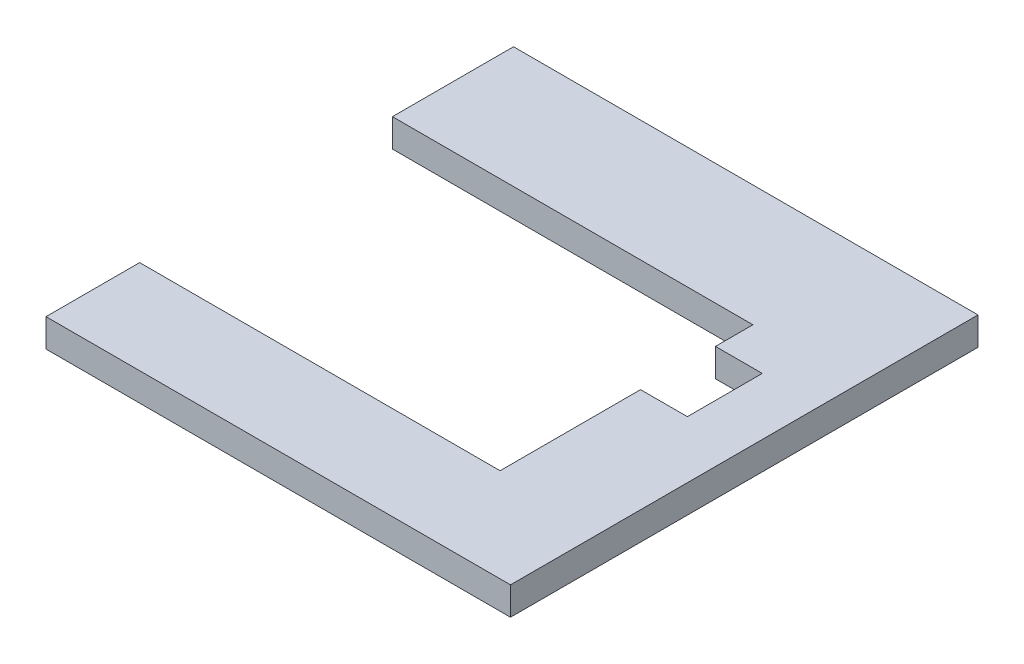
ISO-10303-21;
HEADER;
FILE_DESCRIPTION(('STEP AP214'),'2;1');
FILE_NAME('part.step','',(''),(''),'','','');
FILE_SCHEMA(('AUTOMOTIVE_DESIGN { 1 0 10303 214 1 1 1 1 }'));
ENDSEC;
DATA;
#1=APPLICATION_CONTEXT('core data for automotive mechanical design processes');
#2=APPLICATION_PROTOCOL_DEFINITION('international standard','automotive_design',2000,#1);
#3=PRODUCT_CONTEXT('',#1,'mechanical');
#4=PRODUCT('Part','Part','',(#3));
#5=PRODUCT_RELATED_PRODUCT_CATEGORY('part','',(#4));
#6=PRODUCT_DEFINITION_FORMATION('','',#4);
#7=PRODUCT_DEFINITION_CONTEXT('part definition',#1,'design');
#8=PRODUCT_DEFINITION('design','',#6,#7);
#9=PRODUCT_DEFINITION_SHAPE('','',#8);
#10=(LENGTH_UNIT() NAMED_UNIT(*) SI_UNIT(.MILLI.,.METRE.));
#11=(NAMED_UNIT(*) PLANE_ANGLE_UNIT() SI_UNIT($,.RADIAN.));
#12=(NAMED_UNIT(*) SI_UNIT($,.STERADIAN.) SOLID_ANGLE_UNIT());
#13=UNCERTAINTY_MEASURE_WITH_UNIT(LENGTH_MEASURE(1.E-05),#10,'distance_accuracy_value','');
#14=(GEOMETRIC_REPRESENTATION_CONTEXT(3) GLOBAL_UNCERTAINTY_ASSIGNED_CONTEXT((#13)) GLOBAL_UNIT_ASSIGNED_CONTEXT((#10,
#11,#12)) REPRESENTATION_CONTEXT('',''));
#15=CARTESIAN_POINT('',(0.,0.,0.));
#16=DIRECTION('',(0.,0.,1.));
#17=DIRECTION('',(1.,0.,0.));
#18=AXIS2_PLACEMENT_3D('',#15,#16,#17);
#19=CARTESIAN_POINT('',(49.6102375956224,3.,0.));
#20=DIRECTION('',(1.,0.,0.));
#21=DIRECTION('',(0.,0.,-1.));
#22=AXIS2_PLACEMENT_3D('',#19,#20,#21);
#23=PLANE('',#22);
#24=DIRECTION('',(0.,0.,1.));
#25=VECTOR('',#24,1.);
#26=CARTESIAN_POINT('',(49.6102375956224,0.,0.));
#27=LINE('',#26,#25);
#28=CARTESIAN_POINT('',(49.6102375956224,0.,-49.9319893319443));
#29=VERTEX_POINT('',#28);
#30=CARTESIAN_POINT('',(49.6102375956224,0.,0.));
#31=VERTEX_POINT('',#30);
#32=EDGE_CURVE('E267',#29,#31,#27,.T.);
#33=ORIENTED_EDGE('',*,*,#32,.F.);
#34=DIRECTION('',(0.,-1.,0.));
#35=VECTOR('',#34,1.);
#36=CARTESIAN_POINT('',(49.6102375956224,3.,-49.9319893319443));
#37=LINE('',#36,#35);
#38=CARTESIAN_POINT('',(49.6102375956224,3.,-49.9319893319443));
#39=VERTEX_POINT('',#38);
#40=EDGE_CURVE('E12',#39,#29,#37,.T.);
#41=ORIENTED_EDGE('',*,*,#40,.F.);
#42=DIRECTION('',(0.,0.,1.));
#43=VECTOR('',#42,1.);
#44=CARTESIAN_POINT('',(49.6102375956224,3.,0.));
#45=LINE('',#44,#43);
#46=CARTESIAN_POINT('',(49.6102375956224,3.,0.));
#47=VERTEX_POINT('',#46);
#48=EDGE_CURVE('E214',#39,#47,#45,.T.);
#49=ORIENTED_EDGE('',*,*,#48,.T.);
#50=DIRECTION('',(0.,-1.,0.));
#51=VECTOR('',#50,1.);
#52=CARTESIAN_POINT('',(49.6102375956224,3.,0.));
#53=LINE('',#52,#51);
#54=EDGE_CURVE('E111',#47,#31,#53,.T.);
#55=ORIENTED_EDGE('',*,*,#54,.T.);
#56=EDGE_LOOP('',(#33,#41,#49,#55));
#57=FACE_BOUND('',#56,.T.);
#58=ADVANCED_FACE('F48',(#57),#23,.T.);
#59=CARTESIAN_POINT('',(0.,3.,-49.9319893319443));
#60=DIRECTION('',(0.,0.,-1.));
#61=DIRECTION('',(-1.,0.,0.));
#62=AXIS2_PLACEMENT_3D('',#59,#60,#61);
#63=PLANE('',#62);
#64=DIRECTION('',(1.,0.,0.));
#65=VECTOR('',#64,1.);
#66=CARTESIAN_POINT('',(0.,0.,-49.9319893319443));
#67=LINE('',#66,#65);
#68=CARTESIAN_POINT('',(0.,0.,-49.9319893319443));
#69=VERTEX_POINT('',#68);
#70=EDGE_CURVE('E263',#69,#29,#67,.T.);
#71=ORIENTED_EDGE('',*,*,#70,.F.);
#72=DIRECTION('',(0.,-1.,0.));
#73=VECTOR('',#72,1.);
#74=CARTESIAN_POINT('',(0.,3.,-49.9319893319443));
#75=LINE('',#74,#73);
#76=CARTESIAN_POINT('',(0.,3.,-49.9319893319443));
#77=VERTEX_POINT('',#76);
#78=EDGE_CURVE('E57',#77,#69,#75,.T.);
#79=ORIENTED_EDGE('',*,*,#78,.F.);
#80=DIRECTION('',(1.,0.,0.));
#81=VECTOR('',#80,1.);
#82=CARTESIAN_POINT('',(0.,3.,-49.9319893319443));
#83=LINE('',#82,#81);
#84=EDGE_CURVE('E209',#77,#39,#83,.T.);
#85=ORIENTED_EDGE('',*,*,#84,.T.);
#86=ORIENTED_EDGE('',*,*,#40,.T.);
#87=EDGE_LOOP('',(#71,#79,#85,#86));
#88=FACE_BOUND('',#87,.T.);
#89=ADVANCED_FACE('F264',(#88),#63,.T.);
#90=CARTESIAN_POINT('',(0.,3.,0.));
#91=DIRECTION('',(-1.,0.,0.));
#92=DIRECTION('',(0.,0.,1.));
#93=AXIS2_PLACEMENT_3D('',#90,#91,#92);
#94=PLANE('',#93);
#95=DIRECTION('',(0.,0.,-1.));
#96=VECTOR('',#95,1.);
#97=CARTESIAN_POINT('',(0.,0.,0.));
#98=LINE('',#97,#96);
#99=CARTESIAN_POINT('',(0.,0.,-37.));
#100=VERTEX_POINT('',#99);
#101=EDGE_CURVE('E258',#100,#69,#98,.T.);
#102=ORIENTED_EDGE('',*,*,#101,.F.);
#103=DIRECTION('',(0.,-1.,0.));
#104=VECTOR('',#103,1.);
#105=CARTESIAN_POINT('',(0.,3.,-37.));
#106=LINE('',#105,#104);
#107=CARTESIAN_POINT('',(0.,3.,-37.));
#108=VERTEX_POINT('',#107);
#109=EDGE_CURVE('E250',#108,#100,#106,.T.);
#110=ORIENTED_EDGE('',*,*,#109,.F.);
#111=DIRECTION('',(0.,0.,-1.));
#112=VECTOR('',#111,1.);
#113=CARTESIAN_POINT('',(0.,3.,0.));
#114=LINE('',#113,#112);
#115=EDGE_CURVE('E204',#108,#77,#114,.T.);
#116=ORIENTED_EDGE('',*,*,#115,.T.);
#117=ORIENTED_EDGE('',*,*,#78,.T.);
#118=EDGE_LOOP('',(#102,#110,#116,#117));
#119=FACE_BOUND('',#118,.T.);
#120=ADVANCED_FACE('F256',(#119),#94,.T.);
#121=CARTESIAN_POINT('',(0.,3.,-37.));
#122=DIRECTION('',(0.,0.,-1.));
#123=DIRECTION('',(-1.,0.,0.));
#124=AXIS2_PLACEMENT_3D('',#121,#122,#123);
#125=PLANE('',#124);
#126=DIRECTION('',(1.,0.,0.));
#127=VECTOR('',#126,1.);
#128=CARTESIAN_POINT('',(0.,0.,-37.));
#129=LINE('',#128,#127);
#130=CARTESIAN_POINT('',(38.5,0.,-37.));
#131=VERTEX_POINT('',#130);
#132=EDGE_CURVE('E273',#100,#131,#129,.T.);
#133=ORIENTED_EDGE('',*,*,#132,.T.);
#134=DIRECTION('',(0.,-1.,0.));
#135=VECTOR('',#134,1.);
#136=CARTESIAN_POINT('',(38.5,3.,-37.));
#137=LINE('',#136,#135);
#138=CARTESIAN_POINT('',(38.5,3.,-37.));
#139=VERTEX_POINT('',#138);
#140=EDGE_CURVE('E247',#139,#131,#137,.T.);
#141=ORIENTED_EDGE('',*,*,#140,.F.);
#142=DIRECTION('',(1.,0.,0.));
#143=VECTOR('',#142,1.);
#144=CARTESIAN_POINT('',(0.,3.,-37.));
#145=LINE('',#144,#143);
#146=EDGE_CURVE('E200',#108,#139,#145,.T.);
#147=ORIENTED_EDGE('',*,*,#146,.F.);
#148=ORIENTED_EDGE('',*,*,#109,.T.);
#149=EDGE_LOOP('',(#133,#141,#147,#148));
#150=FACE_BOUND('',#149,.T.);
#151=ADVANCED_FACE('F306',(#150),#125,.F.);
#152=CARTESIAN_POINT('',(38.5,3.,0.));
#153=DIRECTION('',(-1.,0.,0.));
#154=DIRECTION('',(0.,0.,1.));
#155=AXIS2_PLACEMENT_3D('',#152,#153,#154);
#156=PLANE('',#155);
#157=DIRECTION('',(0.,0.,-1.));
#158=VECTOR('',#157,1.);
#159=CARTESIAN_POINT('',(38.5,0.,0.));
#160=LINE('',#159,#158);
#161=CARTESIAN_POINT('',(38.5,0.,-33.));
#162=VERTEX_POINT('',#161);
#163=EDGE_CURVE('E277',#162,#131,#160,.T.);
#164=ORIENTED_EDGE('',*,*,#163,.F.);
#165=DIRECTION('',(0.,-1.,0.));
#166=VECTOR('',#165,1.);
#167=CARTESIAN_POINT('',(38.5,3.,-33.));
#168=LINE('',#167,#166);
#169=CARTESIAN_POINT('',(38.5,3.,-33.));
#170=VERTEX_POINT('',#169);
#171=EDGE_CURVE('E244',#170,#162,#168,.T.);
#172=ORIENTED_EDGE('',*,*,#171,.F.);
#173=DIRECTION('',(0.,0.,-1.));
#174=VECTOR('',#173,1.);
#175=CARTESIAN_POINT('',(38.5,3.,0.));
#176=LINE('',#175,#174);
#177=EDGE_CURVE('E196',#170,#139,#176,.T.);
#178=ORIENTED_EDGE('',*,*,#177,.T.);
#179=ORIENTED_EDGE('',*,*,#140,.T.);
#180=EDGE_LOOP('',(#164,#172,#178,#179));
#181=FACE_BOUND('',#180,.T.);
#182=ADVANCED_FACE('F311',(#181),#156,.T.);
#183=CARTESIAN_POINT('',(0.,3.,-33.));
#184=DIRECTION('',(0.,0.,-1.));
#185=DIRECTION('',(-1.,0.,0.));
#186=AXIS2_PLACEMENT_3D('',#183,#184,#185);
#187=PLANE('',#186);
#188=DIRECTION('',(1.,0.,0.));
#189=VECTOR('',#188,1.);
#190=CARTESIAN_POINT('',(0.,0.,-33.));
#191=LINE('',#190,#189);
#192=CARTESIAN_POINT('',(43.5,0.,-33.));
#193=VERTEX_POINT('',#192);
#194=EDGE_CURVE('E282',#162,#193,#191,.T.);
#195=ORIENTED_EDGE('',*,*,#194,.T.);
#196=DIRECTION('',(0.,-1.,0.));
#197=VECTOR('',#196,1.);
#198=CARTESIAN_POINT('',(43.5,3.,-33.));
#199=LINE('',#198,#197);
#200=CARTESIAN_POINT('',(43.5,3.,-33.));
#201=VERTEX_POINT('',#200);
#202=EDGE_CURVE('E240',#201,#193,#199,.T.);
#203=ORIENTED_EDGE('',*,*,#202,.F.);
#204=DIRECTION('',(1.,0.,0.));
#205=VECTOR('',#204,1.);
#206=CARTESIAN_POINT('',(0.,3.,-33.));
#207=LINE('',#206,#205);
#208=EDGE_CURVE('E188',#170,#201,#207,.T.);
#209=ORIENTED_EDGE('',*,*,#208,.F.);
#210=ORIENTED_EDGE('',*,*,#171,.T.);
#211=EDGE_LOOP('',(#195,#203,#209,#210));
#212=FACE_BOUND('',#211,.T.);
#213=ADVANCED_FACE('F315',(#212),#187,.F.);
#214=CARTESIAN_POINT('',(43.5,3.,0.));
#215=DIRECTION('',(1.,0.,0.));
#216=DIRECTION('',(0.,0.,-1.));
#217=AXIS2_PLACEMENT_3D('',#214,#215,#216);
#218=PLANE('',#217);
#219=DIRECTION('',(0.,0.,1.));
#220=VECTOR('',#219,1.);
#221=CARTESIAN_POINT('',(43.5,0.,0.));
#222=LINE('',#221,#220);
#223=CARTESIAN_POINT('',(43.5,0.,-25.));
#224=VERTEX_POINT('',#223);
#225=EDGE_CURVE('E285',#193,#224,#222,.T.);
#226=ORIENTED_EDGE('',*,*,#225,.T.);
#227=DIRECTION('',(0.,-1.,0.));
#228=VECTOR('',#227,1.);
#229=CARTESIAN_POINT('',(43.5,3.,-25.));
#230=LINE('',#229,#228);
#231=CARTESIAN_POINT('',(43.5,3.,-25.));
#232=VERTEX_POINT('',#231);
#233=EDGE_CURVE('E237',#232,#224,#230,.T.);
#234=ORIENTED_EDGE('',*,*,#233,.F.);
#235=DIRECTION('',(0.,0.,1.));
#236=VECTOR('',#235,1.);
#237=CARTESIAN_POINT('',(43.5,3.,0.));
#238=LINE('',#237,#236);
#239=EDGE_CURVE('E184',#201,#232,#238,.T.);
#240=ORIENTED_EDGE('',*,*,#239,.F.);
#241=ORIENTED_EDGE('',*,*,#202,.T.);
#242=EDGE_LOOP('',(#226,#234,#240,#241));
#243=FACE_BOUND('',#242,.T.);
#244=ADVANCED_FACE('F319',(#243),#218,.F.);
#245=CARTESIAN_POINT('',(0.,3.,-25.));
#246=DIRECTION('',(0.,0.,-1.));
#247=DIRECTION('',(-1.,0.,0.));
#248=AXIS2_PLACEMENT_3D('',#245,#246,#247);
#249=PLANE('',#248);
#250=DIRECTION('',(1.,0.,0.));
#251=VECTOR('',#250,1.);
#252=CARTESIAN_POINT('',(0.,0.,-25.));
#253=LINE('',#252,#251);
#254=CARTESIAN_POINT('',(38.5,0.,-25.));
#255=VERTEX_POINT('',#254);
#256=EDGE_CURVE('E289',#255,#224,#253,.T.);
#257=ORIENTED_EDGE('',*,*,#256,.F.);
#258=DIRECTION('',(0.,-1.,0.));
#259=VECTOR('',#258,1.);
#260=CARTESIAN_POINT('',(38.5,3.,-25.));
#261=LINE('',#260,#259);
#262=CARTESIAN_POINT('',(38.5,3.,-25.));
#263=VERTEX_POINT('',#262);
#264=EDGE_CURVE('E234',#263,#255,#261,.T.);
#265=ORIENTED_EDGE('',*,*,#264,.F.);
#266=DIRECTION('',(1.,0.,0.));
#267=VECTOR('',#266,1.);
#268=CARTESIAN_POINT('',(0.,3.,-25.));
#269=LINE('',#268,#267);
#270=EDGE_CURVE('E179',#263,#232,#269,.T.);
#271=ORIENTED_EDGE('',*,*,#270,.T.);
#272=ORIENTED_EDGE('',*,*,#233,.T.);
#273=EDGE_LOOP('',(#257,#265,#271,#272));
#274=FACE_BOUND('',#273,.T.);
#275=ADVANCED_FACE('F323',(#274),#249,.T.);
#276=CARTESIAN_POINT('',(38.5,3.,0.));
#277=DIRECTION('',(-1.,0.,0.));
#278=DIRECTION('',(0.,0.,1.));
#279=AXIS2_PLACEMENT_3D('',#276,#277,#278);
#280=PLANE('',#279);
#281=DIRECTION('',(0.,0.,-1.));
#282=VECTOR('',#281,1.);
#283=CARTESIAN_POINT('',(38.5,0.,0.));
#284=LINE('',#283,#282);
#285=CARTESIAN_POINT('',(38.5,0.,-10.));
#286=VERTEX_POINT('',#285);
#287=EDGE_CURVE('E293',#286,#255,#284,.T.);
#288=ORIENTED_EDGE('',*,*,#287,.F.);
#289=DIRECTION('',(0.,-1.,0.));
#290=VECTOR('',#289,1.);
#291=CARTESIAN_POINT('',(38.5,3.,-10.));
#292=LINE('',#291,#290);
#293=CARTESIAN_POINT('',(38.5,3.,-10.));
#294=VERTEX_POINT('',#293);
#295=EDGE_CURVE('E153',#294,#286,#292,.T.);
#296=ORIENTED_EDGE('',*,*,#295,.F.);
#297=DIRECTION('',(0.,0.,-1.));
#298=VECTOR('',#297,1.);
#299=CARTESIAN_POINT('',(38.5,3.,0.));
#300=LINE('',#299,#298);
#301=EDGE_CURVE('E160',#294,#263,#300,.T.);
#302=ORIENTED_EDGE('',*,*,#301,.T.);
#303=ORIENTED_EDGE('',*,*,#264,.T.);
#304=EDGE_LOOP('',(#288,#296,#302,#303));
#305=FACE_BOUND('',#304,.T.);
#306=ADVANCED_FACE('F327',(#305),#280,.T.);
#307=CARTESIAN_POINT('',(0.,3.,-10.));
#308=DIRECTION('',(0.,0.,-1.));
#309=DIRECTION('',(-1.,0.,0.));
#310=AXIS2_PLACEMENT_3D('',#307,#308,#309);
#311=PLANE('',#310);
#312=DIRECTION('',(1.,0.,0.));
#313=VECTOR('',#312,1.);
#314=CARTESIAN_POINT('',(0.,0.,-10.));
#315=LINE('',#314,#313);
#316=CARTESIAN_POINT('',(0.,0.,-10.));
#317=VERTEX_POINT('',#316);
#318=EDGE_CURVE('E147',#317,#286,#315,.T.);
#319=ORIENTED_EDGE('',*,*,#318,.F.);
#320=DIRECTION('',(0.,-1.,0.));
#321=VECTOR('',#320,1.);
#322=CARTESIAN_POINT('',(0.,3.,-10.));
#323=LINE('',#322,#321);
#324=CARTESIAN_POINT('',(0.,3.,-10.));
#325=VERTEX_POINT('',#324);
#326=EDGE_CURVE('E142',#325,#317,#323,.T.);
#327=ORIENTED_EDGE('',*,*,#326,.F.);
#328=DIRECTION('',(1.,0.,0.));
#329=VECTOR('',#328,1.);
#330=CARTESIAN_POINT('',(0.,3.,-10.));
#331=LINE('',#330,#329);
#332=EDGE_CURVE('E145',#325,#294,#331,.T.);
#333=ORIENTED_EDGE('',*,*,#332,.T.);
#334=ORIENTED_EDGE('',*,*,#295,.T.);
#335=EDGE_LOOP('',(#319,#327,#333,#334));
#336=FACE_BOUND('',#335,.T.);
#337=ADVANCED_FACE('F144',(#336),#311,.T.);
#338=CARTESIAN_POINT('',(0.,3.,0.));
#339=DIRECTION('',(-1.,0.,0.));
#340=DIRECTION('',(0.,0.,1.));
#341=AXIS2_PLACEMENT_3D('',#338,#339,#340);
#342=PLANE('',#341);
#343=DIRECTION('',(0.,0.,-1.));
#344=VECTOR('',#343,1.);
#345=CARTESIAN_POINT('',(0.,0.,0.));
#346=LINE('',#345,#344);
#347=CARTESIAN_POINT('',(0.,0.,0.));
#348=VERTEX_POINT('',#347);
#349=EDGE_CURVE('E221',#348,#317,#346,.T.);
#350=ORIENTED_EDGE('',*,*,#349,.F.);
#351=DIRECTION('',(0.,-1.,0.));
#352=VECTOR('',#351,1.);
#353=CARTESIAN_POINT('',(0.,3.,0.));
#354=LINE('',#353,#352);
#355=CARTESIAN_POINT('',(0.,3.,0.));
#356=VERTEX_POINT('',#355);
#357=EDGE_CURVE('E104',#356,#348,#354,.T.);
#358=ORIENTED_EDGE('',*,*,#357,.F.);
#359=DIRECTION('',(0.,0.,-1.));
#360=VECTOR('',#359,1.);
#361=CARTESIAN_POINT('',(0.,3.,0.));
#362=LINE('',#361,#360);
#363=EDGE_CURVE('E157',#356,#325,#362,.T.);
#364=ORIENTED_EDGE('',*,*,#363,.T.);
#365=ORIENTED_EDGE('',*,*,#326,.T.);
#366=EDGE_LOOP('',(#350,#358,#364,#365));
#367=FACE_BOUND('',#366,.T.);
#368=ADVANCED_FACE('F163',(#367),#342,.T.);
#369=CARTESIAN_POINT('',(0.,3.,0.));
#370=DIRECTION('',(0.,0.,-1.));
#371=DIRECTION('',(-1.,0.,0.));
#372=AXIS2_PLACEMENT_3D('',#369,#370,#371);
#373=PLANE('',#372);
#374=DIRECTION('',(1.,0.,0.));
#375=VECTOR('',#374,1.);
#376=CARTESIAN_POINT('',(0.,0.,0.));
#377=LINE('',#376,#375);
#378=EDGE_CURVE('E217',#348,#31,#377,.T.);
#379=ORIENTED_EDGE('',*,*,#378,.T.);
#380=ORIENTED_EDGE('',*,*,#54,.F.);
#381=DIRECTION('',(1.,0.,0.));
#382=VECTOR('',#381,1.);
#383=CARTESIAN_POINT('',(0.,3.,0.));
#384=LINE('',#383,#382);
#385=EDGE_CURVE('E65',#356,#47,#384,.T.);
#386=ORIENTED_EDGE('',*,*,#385,.F.);
#387=ORIENTED_EDGE('',*,*,#357,.T.);
#388=EDGE_LOOP('',(#379,#380,#386,#387));
#389=FACE_BOUND('',#388,.T.);
#390=ADVANCED_FACE('F336',(#389),#373,.F.);
#391=CARTESIAN_POINT('',(0.,3.,0.));
#392=DIRECTION('',(0.,1.,0.));
#393=DIRECTION('',(0.,0.,1.));
#394=AXIS2_PLACEMENT_3D('',#391,#392,#393);
#395=PLANE('',#394);
#396=ORIENTED_EDGE('',*,*,#48,.F.);
#397=ORIENTED_EDGE('',*,*,#84,.F.);
#398=ORIENTED_EDGE('',*,*,#115,.F.);
#399=ORIENTED_EDGE('',*,*,#146,.T.);
#400=ORIENTED_EDGE('',*,*,#177,.F.);
#401=ORIENTED_EDGE('',*,*,#208,.T.);
#402=ORIENTED_EDGE('',*,*,#239,.T.);
#403=ORIENTED_EDGE('',*,*,#270,.F.);
#404=ORIENTED_EDGE('',*,*,#301,.F.);
#405=ORIENTED_EDGE('',*,*,#332,.F.);
#406=ORIENTED_EDGE('',*,*,#363,.F.);
#407=ORIENTED_EDGE('',*,*,#385,.T.);
#408=EDGE_LOOP('',(#396,#397,#398,#399,#400,#401,#402,#403,#404,#405,#406,#407));
#409=FACE_BOUND('',#408,.T.);
#410=ADVANCED_FACE('F156',(#409),#395,.T.);
#411=CARTESIAN_POINT('',(0.,0.,0.));
#412=DIRECTION('',(0.,1.,0.));
#413=DIRECTION('',(0.,0.,1.));
#414=AXIS2_PLACEMENT_3D('',#411,#412,#413);
#415=PLANE('',#414);
#416=ORIENTED_EDGE('',*,*,#32,.T.);
#417=ORIENTED_EDGE('',*,*,#378,.F.);
#418=ORIENTED_EDGE('',*,*,#349,.T.);
#419=ORIENTED_EDGE('',*,*,#318,.T.);
#420=ORIENTED_EDGE('',*,*,#287,.T.);
#421=ORIENTED_EDGE('',*,*,#256,.T.);
#422=ORIENTED_EDGE('',*,*,#225,.F.);
#423=ORIENTED_EDGE('',*,*,#194,.F.);
#424=ORIENTED_EDGE('',*,*,#163,.T.);
#425=ORIENTED_EDGE('',*,*,#132,.F.);
#426=ORIENTED_EDGE('',*,*,#101,.T.);
#427=ORIENTED_EDGE('',*,*,#70,.T.);
#428=EDGE_LOOP('',(#416,#417,#418,#419,#420,#421,#422,#423,#424,#425,#426,#427));
#429=FACE_BOUND('',#428,.T.);
#430=ADVANCED_FACE('F270',(#429),#415,.F.);
#431=CLOSED_SHELL('',(#58,#89,#120,#151,#182,#213,#244,#275,#306,#337,#368,#390,#410,#430));
#432=MANIFOLD_SOLID_BREP('B2',#431);
#433=ADVANCED_BREP_SHAPE_REPRESENTATION('',(#18,#432),#14);
#434=SHAPE_DEFINITION_REPRESENTATION(#9,#433);
ENDSEC;
END-ISO-10303-21;
